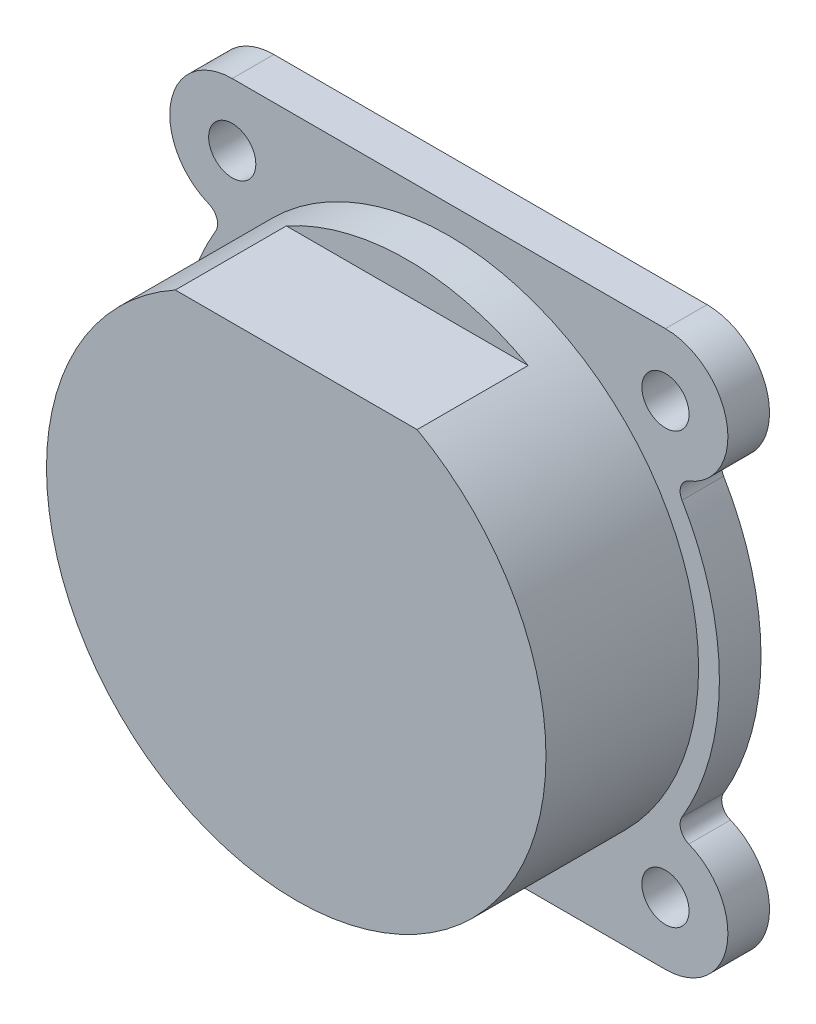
ISO-10303-21;
HEADER;
FILE_DESCRIPTION(('STEP AP214'),'2;1');
FILE_NAME('part.step','',(''),(''),'','','');
FILE_SCHEMA(('AUTOMOTIVE_DESIGN { 1 0 10303 214 1 1 1 1 }'));
ENDSEC;
DATA;
#1=APPLICATION_CONTEXT('core data for automotive mechanical design processes');
#2=APPLICATION_PROTOCOL_DEFINITION('international standard','automotive_design',2000,#1);
#3=PRODUCT_CONTEXT('',#1,'mechanical');
#4=PRODUCT('Part','Part','',(#3));
#5=PRODUCT_RELATED_PRODUCT_CATEGORY('part','',(#4));
#6=PRODUCT_DEFINITION_FORMATION('','',#4);
#7=PRODUCT_DEFINITION_CONTEXT('part definition',#1,'design');
#8=PRODUCT_DEFINITION('design','',#6,#7);
#9=PRODUCT_DEFINITION_SHAPE('','',#8);
#10=(LENGTH_UNIT() NAMED_UNIT(*) SI_UNIT(.MILLI.,.METRE.));
#11=(NAMED_UNIT(*) PLANE_ANGLE_UNIT() SI_UNIT($,.RADIAN.));
#12=(NAMED_UNIT(*) SI_UNIT($,.STERADIAN.) SOLID_ANGLE_UNIT());
#13=UNCERTAINTY_MEASURE_WITH_UNIT(LENGTH_MEASURE(1.E-05),#10,'distance_accuracy_value','');
#14=(GEOMETRIC_REPRESENTATION_CONTEXT(3) GLOBAL_UNCERTAINTY_ASSIGNED_CONTEXT((#13)) GLOBAL_UNIT_ASSIGNED_CONTEXT((#10,
#11,#12)) REPRESENTATION_CONTEXT('',''));
#15=CARTESIAN_POINT('',(0.,0.,0.));
#16=DIRECTION('',(0.,0.,1.));
#17=DIRECTION('',(1.,0.,0.));
#18=AXIS2_PLACEMENT_3D('',#15,#16,#17);
#19=CARTESIAN_POINT('',(-17.6671332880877,-10.398190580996,14.));
#20=DIRECTION('',(0.,0.,-1.));
#21=DIRECTION('',(-1.,0.,0.));
#22=AXIS2_PLACEMENT_3D('',#19,#20,#21);
#23=CYLINDRICAL_SURFACE('',#22,0.99999968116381);
#24=CARTESIAN_POINT('',(-17.6671332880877,-10.398190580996,3.));
#25=DIRECTION('',(0.,0.,1.));
#26=DIRECTION('',(1.,0.,0.));
#27=AXIS2_PLACEMENT_3D('',#24,#25,#26);
#28=CIRCLE('',#27,0.99999968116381);
#29=CARTESIAN_POINT('',(-16.8053221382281,-9.89096193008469,3.));
#30=VERTEX_POINT('',#29);
#31=CARTESIAN_POINT('',(-17.2935626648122,-11.3257919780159,3.));
#32=VERTEX_POINT('',#31);
#33=EDGE_CURVE('E192',#30,#32,#28,.F.);
#34=ORIENTED_EDGE('',*,*,#33,.F.);
#35=DIRECTION('',(0.,0.,-1.));
#36=VECTOR('',#35,1.);
#37=CARTESIAN_POINT('',(-16.8053221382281,-9.89096193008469,14.));
#38=LINE('',#37,#36);
#39=CARTESIAN_POINT('',(-16.8053221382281,-9.89096193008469,0.));
#40=VERTEX_POINT('',#39);
#41=EDGE_CURVE('E230',#30,#40,#38,.T.);
#42=ORIENTED_EDGE('',*,*,#41,.T.);
#43=CARTESIAN_POINT('',(-17.6671332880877,-10.398190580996,0.));
#44=DIRECTION('',(0.,0.,-1.));
#45=DIRECTION('',(-1.,0.,0.));
#46=AXIS2_PLACEMENT_3D('',#43,#44,#45);
#47=CIRCLE('',#46,0.99999968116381);
#48=CARTESIAN_POINT('',(-17.2935626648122,-11.3257919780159,0.));
#49=VERTEX_POINT('',#48);
#50=EDGE_CURVE('E194',#40,#49,#47,.T.);
#51=ORIENTED_EDGE('',*,*,#50,.T.);
#52=DIRECTION('',(0.,0.,-1.));
#53=VECTOR('',#52,1.);
#54=CARTESIAN_POINT('',(-17.2935626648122,-11.3257919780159,14.));
#55=LINE('',#54,#53);
#56=EDGE_CURVE('E252',#32,#49,#55,.T.);
#57=ORIENTED_EDGE('',*,*,#56,.F.);
#58=EDGE_LOOP('',(#34,#42,#51,#57));
#59=FACE_BOUND('',#58,.T.);
#60=ADVANCED_FACE('F32',(#59),#23,.F.);
#61=CARTESIAN_POINT('',(-15.6124942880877,-15.499999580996,14.));
#62=DIRECTION('',(0.,0.,-1.));
#63=DIRECTION('',(-1.,0.,0.));
#64=AXIS2_PLACEMENT_3D('',#61,#62,#63);
#65=CYLINDRICAL_SURFACE('',#64,4.5);
#66=CARTESIAN_POINT('',(-15.6124942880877,-15.499999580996,3.));
#67=DIRECTION('',(0.,0.,1.));
#68=DIRECTION('',(1.,0.,0.));
#69=AXIS2_PLACEMENT_3D('',#66,#67,#68);
#70=CIRCLE('',#69,4.5);
#71=CARTESIAN_POINT('',(-15.612495,-19.9999995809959,3.));
#72=VERTEX_POINT('',#71);
#73=EDGE_CURVE('E190',#32,#72,#70,.T.);
#74=ORIENTED_EDGE('',*,*,#73,.F.);
#75=ORIENTED_EDGE('',*,*,#56,.T.);
#76=CARTESIAN_POINT('',(-15.6124942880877,-15.499999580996,0.));
#77=DIRECTION('',(0.,0.,1.));
#78=DIRECTION('',(-1.,0.,0.));
#79=AXIS2_PLACEMENT_3D('',#76,#77,#78);
#80=CIRCLE('',#79,4.5);
#81=CARTESIAN_POINT('',(-15.612495,-19.9999995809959,0.));
#82=VERTEX_POINT('',#81);
#83=EDGE_CURVE('E197',#49,#82,#80,.T.);
#84=ORIENTED_EDGE('',*,*,#83,.T.);
#85=DIRECTION('',(0.,0.,-1.));
#86=VECTOR('',#85,1.);
#87=CARTESIAN_POINT('',(-15.612495,-19.9999995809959,14.));
#88=LINE('',#87,#86);
#89=EDGE_CURVE('E250',#72,#82,#88,.T.);
#90=ORIENTED_EDGE('',*,*,#89,.F.);
#91=EDGE_LOOP('',(#74,#75,#84,#90));
#92=FACE_BOUND('',#91,.T.);
#93=ADVANCED_FACE('F280',(#92),#65,.T.);
#94=CARTESIAN_POINT('',(-15.612495,-19.9999995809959,14.));
#95=DIRECTION('',(0.,1.,0.));
#96=DIRECTION('',(-1.,0.,0.));
#97=AXIS2_PLACEMENT_3D('',#94,#95,#96);
#98=PLANE('',#97);
#99=DIRECTION('',(1.,0.,0.));
#100=VECTOR('',#99,1.);
#101=CARTESIAN_POINT('',(-15.612495,-19.9999995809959,3.));
#102=LINE('',#101,#100);
#103=CARTESIAN_POINT('',(15.612495,-19.9999995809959,3.));
#104=VERTEX_POINT('',#103);
#105=EDGE_CURVE('E188',#72,#104,#102,.T.);
#106=ORIENTED_EDGE('',*,*,#105,.F.);
#107=ORIENTED_EDGE('',*,*,#89,.T.);
#108=DIRECTION('',(1.,0.,0.));
#109=VECTOR('',#108,1.);
#110=CARTESIAN_POINT('',(-15.612495,-19.9999995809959,0.));
#111=LINE('',#110,#109);
#112=CARTESIAN_POINT('',(15.612495,-19.9999995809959,0.));
#113=VERTEX_POINT('',#112);
#114=EDGE_CURVE('E200',#82,#113,#111,.T.);
#115=ORIENTED_EDGE('',*,*,#114,.T.);
#116=DIRECTION('',(0.,0.,-1.));
#117=VECTOR('',#116,1.);
#118=CARTESIAN_POINT('',(15.612495,-19.9999995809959,14.));
#119=LINE('',#118,#117);
#120=EDGE_CURVE('E248',#104,#113,#119,.T.);
#121=ORIENTED_EDGE('',*,*,#120,.F.);
#122=EDGE_LOOP('',(#106,#107,#115,#121));
#123=FACE_BOUND('',#122,.T.);
#124=ADVANCED_FACE('F285',(#123),#98,.F.);
#125=CARTESIAN_POINT('',(15.6124942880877,-15.499999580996,14.));
#126=DIRECTION('',(0.,0.,-1.));
#127=DIRECTION('',(-1.,0.,0.));
#128=AXIS2_PLACEMENT_3D('',#125,#126,#127);
#129=CYLINDRICAL_SURFACE('',#128,4.5);
#130=CARTESIAN_POINT('',(15.6124942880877,-15.499999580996,3.));
#131=DIRECTION('',(0.,0.,1.));
#132=DIRECTION('',(1.,0.,0.));
#133=AXIS2_PLACEMENT_3D('',#130,#131,#132);
#134=CIRCLE('',#133,4.5);
#135=CARTESIAN_POINT('',(17.2935626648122,-11.3257919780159,3.));
#136=VERTEX_POINT('',#135);
#137=EDGE_CURVE('E186',#104,#136,#134,.T.);
#138=ORIENTED_EDGE('',*,*,#137,.F.);
#139=ORIENTED_EDGE('',*,*,#120,.T.);
#140=CARTESIAN_POINT('',(15.6124942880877,-15.499999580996,0.));
#141=DIRECTION('',(0.,0.,1.));
#142=DIRECTION('',(1.,0.,0.));
#143=AXIS2_PLACEMENT_3D('',#140,#141,#142);
#144=CIRCLE('',#143,4.5);
#145=CARTESIAN_POINT('',(17.2935626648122,-11.3257919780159,0.));
#146=VERTEX_POINT('',#145);
#147=EDGE_CURVE('E203',#113,#146,#144,.T.);
#148=ORIENTED_EDGE('',*,*,#147,.T.);
#149=DIRECTION('',(0.,0.,-1.));
#150=VECTOR('',#149,1.);
#151=CARTESIAN_POINT('',(17.2935626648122,-11.3257919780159,14.));
#152=LINE('',#151,#150);
#153=EDGE_CURVE('E246',#136,#146,#152,.T.);
#154=ORIENTED_EDGE('',*,*,#153,.F.);
#155=EDGE_LOOP('',(#138,#139,#148,#154));
#156=FACE_BOUND('',#155,.T.);
#157=ADVANCED_FACE('F308',(#156),#129,.T.);
#158=CARTESIAN_POINT('',(17.6671332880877,-10.398190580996,14.));
#159=DIRECTION('',(0.,0.,-1.));
#160=DIRECTION('',(-1.,0.,0.));
#161=AXIS2_PLACEMENT_3D('',#158,#159,#160);
#162=CYLINDRICAL_SURFACE('',#161,0.99999968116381);
#163=CARTESIAN_POINT('',(17.6671332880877,-10.398190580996,3.));
#164=DIRECTION('',(0.,0.,1.));
#165=DIRECTION('',(1.,0.,0.));
#166=AXIS2_PLACEMENT_3D('',#163,#164,#165);
#167=CIRCLE('',#166,0.99999968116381);
#168=CARTESIAN_POINT('',(16.8053221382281,-9.89096193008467,3.));
#169=VERTEX_POINT('',#168);
#170=EDGE_CURVE('E184',#136,#169,#167,.F.);
#171=ORIENTED_EDGE('',*,*,#170,.F.);
#172=ORIENTED_EDGE('',*,*,#153,.T.);
#173=CARTESIAN_POINT('',(17.6671332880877,-10.398190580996,0.));
#174=DIRECTION('',(0.,0.,-1.));
#175=DIRECTION('',(1.,0.,0.));
#176=AXIS2_PLACEMENT_3D('',#173,#174,#175);
#177=CIRCLE('',#176,0.99999968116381);
#178=CARTESIAN_POINT('',(16.8053221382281,-9.89096193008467,0.));
#179=VERTEX_POINT('',#178);
#180=EDGE_CURVE('E206',#146,#179,#177,.T.);
#181=ORIENTED_EDGE('',*,*,#180,.T.);
#182=DIRECTION('',(0.,0.,-1.));
#183=VECTOR('',#182,1.);
#184=CARTESIAN_POINT('',(16.8053221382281,-9.89096193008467,14.));
#185=LINE('',#184,#183);
#186=EDGE_CURVE('E244',#169,#179,#185,.T.);
#187=ORIENTED_EDGE('',*,*,#186,.F.);
#188=EDGE_LOOP('',(#171,#172,#181,#187));
#189=FACE_BOUND('',#188,.T.);
#190=ADVANCED_FACE('F315',(#189),#162,.F.);
#191=CARTESIAN_POINT('',(0.,0.,14.));
#192=DIRECTION('',(0.,0.,-1.));
#193=DIRECTION('',(-1.,0.,0.));
#194=AXIS2_PLACEMENT_3D('',#191,#192,#193);
#195=CYLINDRICAL_SURFACE('',#194,19.4999994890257);
#196=CARTESIAN_POINT('',(0.,0.,3.));
#197=DIRECTION('',(0.,0.,1.));
#198=DIRECTION('',(1.,0.,0.));
#199=AXIS2_PLACEMENT_3D('',#196,#197,#198);
#200=CIRCLE('',#199,19.4999994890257);
#201=CARTESIAN_POINT('',(16.8053225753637,9.89096118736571,3.));
#202=VERTEX_POINT('',#201);
#203=EDGE_CURVE('E182',#169,#202,#200,.T.);
#204=ORIENTED_EDGE('',*,*,#203,.F.);
#205=ORIENTED_EDGE('',*,*,#186,.T.);
#206=CARTESIAN_POINT('',(0.,0.,0.));
#207=DIRECTION('',(0.,0.,1.));
#208=DIRECTION('',(1.,0.,0.));
#209=AXIS2_PLACEMENT_3D('',#206,#207,#208);
#210=CIRCLE('',#209,19.4999994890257);
#211=CARTESIAN_POINT('',(16.8053225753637,9.89096118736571,0.));
#212=VERTEX_POINT('',#211);
#213=EDGE_CURVE('E209',#179,#212,#210,.T.);
#214=ORIENTED_EDGE('',*,*,#213,.T.);
#215=DIRECTION('',(0.,0.,-1.));
#216=VECTOR('',#215,1.);
#217=CARTESIAN_POINT('',(16.8053225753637,9.89096118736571,14.));
#218=LINE('',#217,#216);
#219=EDGE_CURVE('E242',#202,#212,#218,.T.);
#220=ORIENTED_EDGE('',*,*,#219,.F.);
#221=EDGE_LOOP('',(#204,#205,#214,#220));
#222=FACE_BOUND('',#221,.T.);
#223=ADVANCED_FACE('F318',(#222),#195,.T.);
#224=CARTESIAN_POINT('',(17.667134,10.39819,14.));
#225=DIRECTION('',(0.,0.,-1.));
#226=DIRECTION('',(-1.,0.,0.));
#227=AXIS2_PLACEMENT_3D('',#224,#225,#226);
#228=CYLINDRICAL_SURFACE('',#227,1.00000000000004);
#229=CARTESIAN_POINT('',(17.667134,10.39819,3.));
#230=DIRECTION('',(0.,0.,1.));
#231=DIRECTION('',(1.,0.,0.));
#232=AXIS2_PLACEMENT_3D('',#229,#230,#231);
#233=CIRCLE('',#232,1.00000000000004);
#234=CARTESIAN_POINT('',(17.2935636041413,11.3257918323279,3.));
#235=VERTEX_POINT('',#234);
#236=EDGE_CURVE('E180',#202,#235,#233,.F.);
#237=ORIENTED_EDGE('',*,*,#236,.F.);
#238=ORIENTED_EDGE('',*,*,#219,.T.);
#239=CARTESIAN_POINT('',(17.667134,10.39819,0.));
#240=DIRECTION('',(0.,0.,-1.));
#241=DIRECTION('',(1.,0.,0.));
#242=AXIS2_PLACEMENT_3D('',#239,#240,#241);
#243=CIRCLE('',#242,1.00000000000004);
#244=CARTESIAN_POINT('',(17.2935636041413,11.3257918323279,0.));
#245=VERTEX_POINT('',#244);
#246=EDGE_CURVE('E212',#212,#245,#243,.T.);
#247=ORIENTED_EDGE('',*,*,#246,.T.);
#248=DIRECTION('',(0.,0.,-1.));
#249=VECTOR('',#248,1.);
#250=CARTESIAN_POINT('',(17.2935636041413,11.3257918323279,14.));
#251=LINE('',#250,#249);
#252=EDGE_CURVE('E240',#235,#245,#251,.T.);
#253=ORIENTED_EDGE('',*,*,#252,.F.);
#254=EDGE_LOOP('',(#237,#238,#247,#253));
#255=FACE_BOUND('',#254,.T.);
#256=ADVANCED_FACE('F325',(#255),#228,.F.);
#257=CARTESIAN_POINT('',(15.6124952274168,15.499999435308,14.));
#258=DIRECTION('',(0.,0.,-1.));
#259=DIRECTION('',(-1.,0.,0.));
#260=AXIS2_PLACEMENT_3D('',#257,#258,#259);
#261=CYLINDRICAL_SURFACE('',#260,4.5);
#262=CARTESIAN_POINT('',(15.6124952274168,15.499999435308,3.));
#263=DIRECTION('',(0.,0.,1.));
#264=DIRECTION('',(1.,0.,0.));
#265=AXIS2_PLACEMENT_3D('',#262,#263,#264);
#266=CIRCLE('',#265,4.5);
#267=CARTESIAN_POINT('',(15.6124952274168,19.999999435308,3.));
#268=VERTEX_POINT('',#267);
#269=EDGE_CURVE('E178',#235,#268,#266,.T.);
#270=ORIENTED_EDGE('',*,*,#269,.F.);
#271=ORIENTED_EDGE('',*,*,#252,.T.);
#272=CARTESIAN_POINT('',(15.6124952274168,15.499999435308,0.));
#273=DIRECTION('',(0.,0.,1.));
#274=DIRECTION('',(1.,0.,0.));
#275=AXIS2_PLACEMENT_3D('',#272,#273,#274);
#276=CIRCLE('',#275,4.5);
#277=CARTESIAN_POINT('',(15.6124952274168,19.999999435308,0.));
#278=VERTEX_POINT('',#277);
#279=EDGE_CURVE('E215',#245,#278,#276,.T.);
#280=ORIENTED_EDGE('',*,*,#279,.T.);
#281=DIRECTION('',(0.,0.,-1.));
#282=VECTOR('',#281,1.);
#283=CARTESIAN_POINT('',(15.6124952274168,19.999999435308,14.));
#284=LINE('',#283,#282);
#285=EDGE_CURVE('E238',#268,#278,#284,.T.);
#286=ORIENTED_EDGE('',*,*,#285,.F.);
#287=EDGE_LOOP('',(#270,#271,#280,#286));
#288=FACE_BOUND('',#287,.T.);
#289=ADVANCED_FACE('F328',(#288),#261,.T.);
#290=CARTESIAN_POINT('',(15.6124952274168,19.999999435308,14.));
#291=DIRECTION('',(-1.81500077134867E-08,-1.,0.));
#292=DIRECTION('',(1.,-1.81500077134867E-08,0.));
#293=AXIS2_PLACEMENT_3D('',#290,#291,#292);
#294=PLANE('',#293);
#295=DIRECTION('',(-1.,1.81500077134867E-08,0.));
#296=VECTOR('',#295,1.);
#297=CARTESIAN_POINT('',(15.6124952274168,19.999999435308,3.));
#298=LINE('',#297,#296);
#299=CARTESIAN_POINT('',(-15.6124951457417,19.9999997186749,3.));
#300=VERTEX_POINT('',#299);
#301=EDGE_CURVE('E176',#268,#300,#298,.T.);
#302=ORIENTED_EDGE('',*,*,#301,.F.);
#303=ORIENTED_EDGE('',*,*,#285,.T.);
#304=DIRECTION('',(-1.,1.81500077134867E-08,0.));
#305=VECTOR('',#304,1.);
#306=CARTESIAN_POINT('',(15.6124952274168,19.999999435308,0.));
#307=LINE('',#306,#305);
#308=CARTESIAN_POINT('',(-15.6124951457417,19.9999997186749,0.));
#309=VERTEX_POINT('',#308);
#310=EDGE_CURVE('E218',#278,#309,#307,.T.);
#311=ORIENTED_EDGE('',*,*,#310,.T.);
#312=DIRECTION('',(0.,0.,-1.));
#313=VECTOR('',#312,1.);
#314=CARTESIAN_POINT('',(-15.6124951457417,19.9999997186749,14.));
#315=LINE('',#314,#313);
#316=EDGE_CURVE('E236',#300,#309,#315,.T.);
#317=ORIENTED_EDGE('',*,*,#316,.F.);
#318=EDGE_LOOP('',(#302,#303,#311,#317));
#319=FACE_BOUND('',#318,.T.);
#320=ADVANCED_FACE('F335',(#319),#294,.F.);
#321=CARTESIAN_POINT('',(-15.6124952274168,15.499999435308,14.));
#322=DIRECTION('',(0.,0.,-1.));
#323=DIRECTION('',(-1.,0.,0.));
#324=AXIS2_PLACEMENT_3D('',#321,#322,#323);
#325=CYLINDRICAL_SURFACE('',#324,4.50000028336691);
#326=CARTESIAN_POINT('',(-15.6124952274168,15.499999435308,3.));
#327=DIRECTION('',(0.,0.,1.));
#328=DIRECTION('',(1.,0.,0.));
#329=AXIS2_PLACEMENT_3D('',#326,#327,#328);
#330=CIRCLE('',#329,4.50000028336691);
#331=CARTESIAN_POINT('',(-17.2935636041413,11.3257918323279,3.));
#332=VERTEX_POINT('',#331);
#333=EDGE_CURVE('E174',#300,#332,#330,.T.);
#334=ORIENTED_EDGE('',*,*,#333,.F.);
#335=ORIENTED_EDGE('',*,*,#316,.T.);
#336=CARTESIAN_POINT('',(-15.6124952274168,15.499999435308,0.));
#337=DIRECTION('',(0.,0.,1.));
#338=DIRECTION('',(-1.,0.,0.));
#339=AXIS2_PLACEMENT_3D('',#336,#337,#338);
#340=CIRCLE('',#339,4.50000028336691);
#341=CARTESIAN_POINT('',(-17.2935636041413,11.3257918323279,0.));
#342=VERTEX_POINT('',#341);
#343=EDGE_CURVE('E221',#309,#342,#340,.T.);
#344=ORIENTED_EDGE('',*,*,#343,.T.);
#345=DIRECTION('',(0.,0.,-1.));
#346=VECTOR('',#345,1.);
#347=CARTESIAN_POINT('',(-17.2935636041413,11.3257918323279,14.));
#348=LINE('',#347,#346);
#349=EDGE_CURVE('E234',#332,#342,#348,.T.);
#350=ORIENTED_EDGE('',*,*,#349,.F.);
#351=EDGE_LOOP('',(#334,#335,#344,#350));
#352=FACE_BOUND('',#351,.T.);
#353=ADVANCED_FACE('F338',(#352),#325,.T.);
#354=CARTESIAN_POINT('',(-17.667134,10.39819,14.));
#355=DIRECTION('',(0.,0.,-1.));
#356=DIRECTION('',(-1.,0.,0.));
#357=AXIS2_PLACEMENT_3D('',#354,#355,#356);
#358=CYLINDRICAL_SURFACE('',#357,1.00000000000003);
#359=CARTESIAN_POINT('',(-17.667134,10.39819,3.));
#360=DIRECTION('',(0.,0.,1.));
#361=DIRECTION('',(1.,0.,0.));
#362=AXIS2_PLACEMENT_3D('',#359,#360,#361);
#363=CIRCLE('',#362,1.00000000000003);
#364=CARTESIAN_POINT('',(-16.8053225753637,9.8909611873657,3.));
#365=VERTEX_POINT('',#364);
#366=EDGE_CURVE('E54',#332,#365,#363,.F.);
#367=ORIENTED_EDGE('',*,*,#366,.F.);
#368=ORIENTED_EDGE('',*,*,#349,.T.);
#369=CARTESIAN_POINT('',(-17.667134,10.39819,0.));
#370=DIRECTION('',(0.,0.,-1.));
#371=DIRECTION('',(-1.,0.,0.));
#372=AXIS2_PLACEMENT_3D('',#369,#370,#371);
#373=CIRCLE('',#372,1.00000000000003);
#374=CARTESIAN_POINT('',(-16.8053225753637,9.8909611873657,0.));
#375=VERTEX_POINT('',#374);
#376=EDGE_CURVE('E224',#342,#375,#373,.T.);
#377=ORIENTED_EDGE('',*,*,#376,.T.);
#378=DIRECTION('',(0.,0.,-1.));
#379=VECTOR('',#378,1.);
#380=CARTESIAN_POINT('',(-16.8053225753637,9.8909611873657,14.));
#381=LINE('',#380,#379);
#382=EDGE_CURVE('E232',#365,#375,#381,.T.);
#383=ORIENTED_EDGE('',*,*,#382,.F.);
#384=EDGE_LOOP('',(#367,#368,#377,#383));
#385=FACE_BOUND('',#384,.T.);
#386=ADVANCED_FACE('F341',(#385),#358,.F.);
#387=CARTESIAN_POINT('',(0.,0.,14.));
#388=DIRECTION('',(0.,0.,-1.));
#389=DIRECTION('',(-1.,0.,0.));
#390=AXIS2_PLACEMENT_3D('',#387,#388,#389);
#391=CYLINDRICAL_SURFACE('',#390,19.4999994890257);
#392=CARTESIAN_POINT('',(0.,0.,3.));
#393=DIRECTION('',(0.,0.,1.));
#394=DIRECTION('',(1.,0.,0.));
#395=AXIS2_PLACEMENT_3D('',#392,#393,#394);
#396=CIRCLE('',#395,19.4999994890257);
#397=EDGE_CURVE('E254',#365,#30,#396,.T.);
#398=ORIENTED_EDGE('',*,*,#397,.F.);
#399=ORIENTED_EDGE('',*,*,#382,.T.);
#400=CARTESIAN_POINT('',(0.,0.,0.));
#401=DIRECTION('',(0.,0.,1.));
#402=DIRECTION('',(-1.,0.,0.));
#403=AXIS2_PLACEMENT_3D('',#400,#401,#402);
#404=CIRCLE('',#403,19.4999994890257);
#405=EDGE_CURVE('E227',#375,#40,#404,.T.);
#406=ORIENTED_EDGE('',*,*,#405,.T.);
#407=ORIENTED_EDGE('',*,*,#41,.F.);
#408=EDGE_LOOP('',(#398,#399,#406,#407));
#409=FACE_BOUND('',#408,.T.);
#410=ADVANCED_FACE('F292',(#409),#391,.T.);
#411=CARTESIAN_POINT('',(-17.6671332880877,-10.398190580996,0.));
#412=DIRECTION('',(0.,0.,-1.));
#413=DIRECTION('',(-1.,0.,0.));
#414=AXIS2_PLACEMENT_3D('',#411,#412,#413);
#415=PLANE('',#414);
#416=CARTESIAN_POINT('',(0.,0.,0.));
#417=DIRECTION('',(0.,0.,-1.));
#418=DIRECTION('',(-1.,0.,0.));
#419=AXIS2_PLACEMENT_3D('',#416,#417,#418);
#420=CIRCLE('',#419,15.);
#421=CARTESIAN_POINT('',(-15.,0.,0.));
#422=VERTEX_POINT('',#421);
#423=EDGE_CURVE('E138',#422,#422,#420,.T.);
#424=ORIENTED_EDGE('',*,*,#423,.F.);
#425=EDGE_LOOP('',(#424));
#426=FACE_BOUND('',#425,.T.);
#427=CARTESIAN_POINT('',(15.6124952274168,15.499999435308,0.));
#428=DIRECTION('',(0.,0.,-1.));
#429=DIRECTION('',(-1.,0.,0.));
#430=AXIS2_PLACEMENT_3D('',#427,#428,#429);
#431=CIRCLE('',#430,1.69999999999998);
#432=CARTESIAN_POINT('',(13.9124952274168,15.499999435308,0.));
#433=VERTEX_POINT('',#432);
#434=EDGE_CURVE('E156',#433,#433,#431,.T.);
#435=ORIENTED_EDGE('',*,*,#434,.F.);
#436=EDGE_LOOP('',(#435));
#437=FACE_BOUND('',#436,.T.);
#438=CARTESIAN_POINT('',(15.6124942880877,-15.499999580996,0.));
#439=DIRECTION('',(0.,0.,-1.));
#440=DIRECTION('',(-1.,0.,0.));
#441=AXIS2_PLACEMENT_3D('',#438,#439,#440);
#442=CIRCLE('',#441,1.69999999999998);
#443=CARTESIAN_POINT('',(13.9124942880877,-15.499999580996,0.));
#444=VERTEX_POINT('',#443);
#445=EDGE_CURVE('E160',#444,#444,#442,.T.);
#446=ORIENTED_EDGE('',*,*,#445,.F.);
#447=EDGE_LOOP('',(#446));
#448=FACE_BOUND('',#447,.T.);
#449=CARTESIAN_POINT('',(-15.6124952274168,15.499999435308,0.));
#450=DIRECTION('',(0.,0.,-1.));
#451=DIRECTION('',(-1.,0.,0.));
#452=AXIS2_PLACEMENT_3D('',#449,#450,#451);
#453=CIRCLE('',#452,1.69999999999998);
#454=CARTESIAN_POINT('',(-17.3124952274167,15.499999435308,0.));
#455=VERTEX_POINT('',#454);
#456=EDGE_CURVE('E164',#455,#455,#453,.T.);
#457=ORIENTED_EDGE('',*,*,#456,.F.);
#458=EDGE_LOOP('',(#457));
#459=FACE_BOUND('',#458,.T.);
#460=CARTESIAN_POINT('',(-15.6124942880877,-15.499999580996,0.));
#461=DIRECTION('',(0.,0.,-1.));
#462=DIRECTION('',(-1.,0.,0.));
#463=AXIS2_PLACEMENT_3D('',#460,#461,#462);
#464=CIRCLE('',#463,1.69999999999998);
#465=CARTESIAN_POINT('',(-17.3124942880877,-15.499999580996,0.));
#466=VERTEX_POINT('',#465);
#467=EDGE_CURVE('E168',#466,#466,#464,.T.);
#468=ORIENTED_EDGE('',*,*,#467,.F.);
#469=EDGE_LOOP('',(#468));
#470=FACE_BOUND('',#469,.T.);
#471=ORIENTED_EDGE('',*,*,#50,.F.);
#472=ORIENTED_EDGE('',*,*,#405,.F.);
#473=ORIENTED_EDGE('',*,*,#376,.F.);
#474=ORIENTED_EDGE('',*,*,#343,.F.);
#475=ORIENTED_EDGE('',*,*,#310,.F.);
#476=ORIENTED_EDGE('',*,*,#279,.F.);
#477=ORIENTED_EDGE('',*,*,#246,.F.);
#478=ORIENTED_EDGE('',*,*,#213,.F.);
#479=ORIENTED_EDGE('',*,*,#180,.F.);
#480=ORIENTED_EDGE('',*,*,#147,.F.);
#481=ORIENTED_EDGE('',*,*,#114,.F.);
#482=ORIENTED_EDGE('',*,*,#83,.F.);
#483=EDGE_LOOP('',(#471,#472,#473,#474,#475,#476,#477,#478,#479,#480,#481,#482));
#484=FACE_BOUND('',#483,.T.);
#485=ADVANCED_FACE('F299',(#426,#437,#448,#459,#470,#484),#415,.T.);
#486=CARTESIAN_POINT('',(0.,0.,3.));
#487=DIRECTION('',(0.,0.,1.));
#488=DIRECTION('',(1.,0.,0.));
#489=AXIS2_PLACEMENT_3D('',#486,#487,#488);
#490=PLANE('',#489);
#491=CARTESIAN_POINT('',(15.6124952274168,15.499999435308,3.));
#492=DIRECTION('',(0.,0.,1.));
#493=DIRECTION('',(1.,0.,0.));
#494=AXIS2_PLACEMENT_3D('',#491,#492,#493);
#495=CIRCLE('',#494,1.69999999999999);
#496=CARTESIAN_POINT('',(17.3124952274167,15.499999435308,3.));
#497=VERTEX_POINT('',#496);
#498=EDGE_CURVE('E153',#497,#497,#495,.T.);
#499=ORIENTED_EDGE('',*,*,#498,.F.);
#500=EDGE_LOOP('',(#499));
#501=FACE_BOUND('',#500,.T.);
#502=CARTESIAN_POINT('',(15.6124942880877,-15.499999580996,3.));
#503=DIRECTION('',(0.,0.,1.));
#504=DIRECTION('',(1.,0.,0.));
#505=AXIS2_PLACEMENT_3D('',#502,#503,#504);
#506=CIRCLE('',#505,1.69999999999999);
#507=CARTESIAN_POINT('',(17.3124942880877,-15.499999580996,3.));
#508=VERTEX_POINT('',#507);
#509=EDGE_CURVE('E157',#508,#508,#506,.T.);
#510=ORIENTED_EDGE('',*,*,#509,.F.);
#511=EDGE_LOOP('',(#510));
#512=FACE_BOUND('',#511,.T.);
#513=CARTESIAN_POINT('',(-15.6124952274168,15.499999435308,3.));
#514=DIRECTION('',(0.,0.,1.));
#515=DIRECTION('',(1.,0.,0.));
#516=AXIS2_PLACEMENT_3D('',#513,#514,#515);
#517=CIRCLE('',#516,1.69999999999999);
#518=CARTESIAN_POINT('',(-13.9124952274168,15.499999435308,3.));
#519=VERTEX_POINT('',#518);
#520=EDGE_CURVE('E161',#519,#519,#517,.T.);
#521=ORIENTED_EDGE('',*,*,#520,.F.);
#522=EDGE_LOOP('',(#521));
#523=FACE_BOUND('',#522,.T.);
#524=CARTESIAN_POINT('',(-15.6124942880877,-15.499999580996,3.));
#525=DIRECTION('',(0.,0.,1.));
#526=DIRECTION('',(1.,0.,0.));
#527=AXIS2_PLACEMENT_3D('',#524,#525,#526);
#528=CIRCLE('',#527,1.69999999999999);
#529=CARTESIAN_POINT('',(-13.9124942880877,-15.499999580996,3.));
#530=VERTEX_POINT('',#529);
#531=EDGE_CURVE('E165',#530,#530,#528,.T.);
#532=ORIENTED_EDGE('',*,*,#531,.F.);
#533=EDGE_LOOP('',(#532));
#534=FACE_BOUND('',#533,.T.);
#535=CARTESIAN_POINT('',(0.,0.,3.));
#536=DIRECTION('',(0.,0.,1.));
#537=DIRECTION('',(1.,0.,0.));
#538=AXIS2_PLACEMENT_3D('',#535,#536,#537);
#539=CIRCLE('',#538,18.);
#540=CARTESIAN_POINT('',(18.,0.,3.));
#541=VERTEX_POINT('',#540);
#542=EDGE_CURVE('E170',#541,#541,#539,.T.);
#543=ORIENTED_EDGE('',*,*,#542,.F.);
#544=EDGE_LOOP('',(#543));
#545=FACE_BOUND('',#544,.T.);
#546=ORIENTED_EDGE('',*,*,#33,.T.);
#547=ORIENTED_EDGE('',*,*,#73,.T.);
#548=ORIENTED_EDGE('',*,*,#105,.T.);
#549=ORIENTED_EDGE('',*,*,#137,.T.);
#550=ORIENTED_EDGE('',*,*,#170,.T.);
#551=ORIENTED_EDGE('',*,*,#203,.T.);
#552=ORIENTED_EDGE('',*,*,#236,.T.);
#553=ORIENTED_EDGE('',*,*,#269,.T.);
#554=ORIENTED_EDGE('',*,*,#301,.T.);
#555=ORIENTED_EDGE('',*,*,#333,.T.);
#556=ORIENTED_EDGE('',*,*,#366,.T.);
#557=ORIENTED_EDGE('',*,*,#397,.T.);
#558=EDGE_LOOP('',(#546,#547,#548,#549,#550,#551,#552,#553,#554,#555,#556,#557));
#559=FACE_BOUND('',#558,.T.);
#560=ADVANCED_FACE('F275',(#501,#512,#523,#534,#545,#559),#490,.T.);
#561=CARTESIAN_POINT('',(0.,0.,3.));
#562=DIRECTION('',(0.,0.,1.));
#563=DIRECTION('',(1.,0.,0.));
#564=AXIS2_PLACEMENT_3D('',#561,#562,#563);
#565=CYLINDRICAL_SURFACE('',#564,18.);
#566=DIRECTION('',(0.,0.,1.));
#567=VECTOR('',#566,1.);
#568=CARTESIAN_POINT('',(8.71421252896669,15.75,3.));
#569=LINE('',#568,#567);
#570=CARTESIAN_POINT('',(8.71421252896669,15.75,14.));
#571=VERTEX_POINT('',#570);
#572=CARTESIAN_POINT('',(8.71421252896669,15.75,6.));
#573=VERTEX_POINT('',#572);
#574=EDGE_CURVE('E131',#571,#573,#569,.F.);
#575=ORIENTED_EDGE('',*,*,#574,.F.);
#576=CARTESIAN_POINT('',(0.,0.,14.));
#577=DIRECTION('',(0.,0.,1.));
#578=DIRECTION('',(1.,0.,0.));
#579=AXIS2_PLACEMENT_3D('',#576,#577,#578);
#580=CIRCLE('',#579,18.);
#581=CARTESIAN_POINT('',(-8.71421252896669,15.75,14.));
#582=VERTEX_POINT('',#581);
#583=EDGE_CURVE('E145',#582,#571,#580,.T.);
#584=ORIENTED_EDGE('',*,*,#583,.F.);
#585=DIRECTION('',(0.,0.,1.));
#586=VECTOR('',#585,1.);
#587=CARTESIAN_POINT('',(-8.71421252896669,15.75,3.));
#588=LINE('',#587,#586);
#589=CARTESIAN_POINT('',(-8.71421252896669,15.75,6.));
#590=VERTEX_POINT('',#589);
#591=EDGE_CURVE('E46',#590,#582,#588,.T.);
#592=ORIENTED_EDGE('',*,*,#591,.F.);
#593=CARTESIAN_POINT('',(0.,0.,6.));
#594=DIRECTION('',(0.,0.,1.));
#595=DIRECTION('',(1.,0.,0.));
#596=AXIS2_PLACEMENT_3D('',#593,#594,#595);
#597=CIRCLE('',#596,18.);
#598=EDGE_CURVE('E11',#590,#573,#597,.F.);
#599=ORIENTED_EDGE('',*,*,#598,.T.);
#600=EDGE_LOOP('',(#575,#584,#592,#599));
#601=FACE_BOUND('',#600,.T.);
#602=ORIENTED_EDGE('',*,*,#542,.T.);
#603=EDGE_LOOP('',(#602));
#604=FACE_BOUND('',#603,.T.);
#605=ADVANCED_FACE('F143',(#601,#604),#565,.T.);
#606=CARTESIAN_POINT('',(-17.6671332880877,-10.398190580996,14.));
#607=DIRECTION('',(0.,0.,-1.));
#608=DIRECTION('',(-1.,0.,0.));
#609=AXIS2_PLACEMENT_3D('',#606,#607,#608);
#610=PLANE('',#609);
#611=ORIENTED_EDGE('',*,*,#583,.T.);
#612=DIRECTION('',(-1.,0.,0.));
#613=VECTOR('',#612,1.);
#614=CARTESIAN_POINT('',(-17.6671332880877,15.75,14.));
#615=LINE('',#614,#613);
#616=EDGE_CURVE('E39',#571,#582,#615,.T.);
#617=ORIENTED_EDGE('',*,*,#616,.T.);
#618=EDGE_LOOP('',(#611,#617));
#619=FACE_BOUND('',#618,.T.);
#620=ADVANCED_FACE('F264',(#619),#610,.F.);
#621=CARTESIAN_POINT('',(-15.6124942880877,-15.499999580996,3.));
#622=DIRECTION('',(0.,0.,1.));
#623=DIRECTION('',(1.,0.,0.));
#624=AXIS2_PLACEMENT_3D('',#621,#622,#623);
#625=CYLINDRICAL_SURFACE('',#624,1.69999999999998);
#626=ORIENTED_EDGE('',*,*,#467,.T.);
#627=EDGE_LOOP('',(#626));
#628=FACE_BOUND('',#627,.T.);
#629=ORIENTED_EDGE('',*,*,#531,.T.);
#630=EDGE_LOOP('',(#629));
#631=FACE_BOUND('',#630,.T.);
#632=ADVANCED_FACE('F266',(#628,#631),#625,.F.);
#633=CARTESIAN_POINT('',(-15.6124952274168,15.499999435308,3.));
#634=DIRECTION('',(0.,0.,1.));
#635=DIRECTION('',(1.,0.,0.));
#636=AXIS2_PLACEMENT_3D('',#633,#634,#635);
#637=CYLINDRICAL_SURFACE('',#636,1.69999999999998);
#638=ORIENTED_EDGE('',*,*,#456,.T.);
#639=EDGE_LOOP('',(#638));
#640=FACE_BOUND('',#639,.T.);
#641=ORIENTED_EDGE('',*,*,#520,.T.);
#642=EDGE_LOOP('',(#641));
#643=FACE_BOUND('',#642,.T.);
#644=ADVANCED_FACE('F272',(#640,#643),#637,.F.);
#645=CARTESIAN_POINT('',(15.6124942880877,-15.499999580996,3.));
#646=DIRECTION('',(0.,0.,1.));
#647=DIRECTION('',(1.,0.,0.));
#648=AXIS2_PLACEMENT_3D('',#645,#646,#647);
#649=CYLINDRICAL_SURFACE('',#648,1.69999999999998);
#650=ORIENTED_EDGE('',*,*,#445,.T.);
#651=EDGE_LOOP('',(#650));
#652=FACE_BOUND('',#651,.T.);
#653=ORIENTED_EDGE('',*,*,#509,.T.);
#654=EDGE_LOOP('',(#653));
#655=FACE_BOUND('',#654,.T.);
#656=ADVANCED_FACE('F448',(#652,#655),#649,.F.);
#657=CARTESIAN_POINT('',(15.6124952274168,15.499999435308,3.));
#658=DIRECTION('',(0.,0.,1.));
#659=DIRECTION('',(1.,0.,0.));
#660=AXIS2_PLACEMENT_3D('',#657,#658,#659);
#661=CYLINDRICAL_SURFACE('',#660,1.69999999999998);
#662=ORIENTED_EDGE('',*,*,#434,.T.);
#663=EDGE_LOOP('',(#662));
#664=FACE_BOUND('',#663,.T.);
#665=ORIENTED_EDGE('',*,*,#498,.T.);
#666=EDGE_LOOP('',(#665));
#667=FACE_BOUND('',#666,.T.);
#668=ADVANCED_FACE('F458',(#664,#667),#661,.F.);
#669=CARTESIAN_POINT('',(0.,0.,11.));
#670=DIRECTION('',(0.,0.,-1.));
#671=DIRECTION('',(-1.,0.,0.));
#672=AXIS2_PLACEMENT_3D('',#669,#670,#671);
#673=CYLINDRICAL_SURFACE('',#672,15.);
#674=CARTESIAN_POINT('',(0.,0.,11.));
#675=DIRECTION('',(0.,0.,-1.));
#676=DIRECTION('',(-1.,0.,0.));
#677=AXIS2_PLACEMENT_3D('',#674,#675,#676);
#678=CIRCLE('',#677,15.);
#679=CARTESIAN_POINT('',(-15.,0.,11.));
#680=VERTEX_POINT('',#679);
#681=EDGE_CURVE('E150',#680,#680,#678,.T.);
#682=ORIENTED_EDGE('',*,*,#681,.F.);
#683=EDGE_LOOP('',(#682));
#684=FACE_BOUND('',#683,.T.);
#685=ORIENTED_EDGE('',*,*,#423,.T.);
#686=EDGE_LOOP('',(#685));
#687=FACE_BOUND('',#686,.T.);
#688=ADVANCED_FACE('F468',(#684,#687),#673,.F.);
#689=CARTESIAN_POINT('',(0.,0.,11.));
#690=DIRECTION('',(0.,0.,-1.));
#691=DIRECTION('',(-1.,0.,0.));
#692=AXIS2_PLACEMENT_3D('',#689,#690,#691);
#693=PLANE('',#692);
#694=ORIENTED_EDGE('',*,*,#681,.T.);
#695=EDGE_LOOP('',(#694));
#696=FACE_BOUND('',#695,.T.);
#697=ADVANCED_FACE('F478',(#696),#693,.T.);
#698=CARTESIAN_POINT('',(-20.,19.9999997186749,6.));
#699=DIRECTION('',(0.,0.,1.));
#700=DIRECTION('',(1.,0.,0.));
#701=AXIS2_PLACEMENT_3D('',#698,#699,#700);
#702=PLANE('',#701);
#703=DIRECTION('',(-1.,0.,0.));
#704=VECTOR('',#703,1.);
#705=CARTESIAN_POINT('',(-20.,15.75,6.));
#706=LINE('',#705,#704);
#707=EDGE_CURVE('E134',#573,#590,#706,.T.);
#708=ORIENTED_EDGE('',*,*,#707,.F.);
#709=ORIENTED_EDGE('',*,*,#598,.F.);
#710=EDGE_LOOP('',(#708,#709));
#711=FACE_BOUND('',#710,.T.);
#712=ADVANCED_FACE('F141',(#711),#702,.T.);
#713=CARTESIAN_POINT('',(-20.,15.75,14.));
#714=DIRECTION('',(0.,-1.,0.));
#715=DIRECTION('',(0.,0.,-1.));
#716=AXIS2_PLACEMENT_3D('',#713,#714,#715);
#717=PLANE('',#716);
#718=ORIENTED_EDGE('',*,*,#574,.T.);
#719=ORIENTED_EDGE('',*,*,#707,.T.);
#720=ORIENTED_EDGE('',*,*,#591,.T.);
#721=ORIENTED_EDGE('',*,*,#616,.F.);
#722=EDGE_LOOP('',(#718,#719,#720,#721));
#723=FACE_BOUND('',#722,.T.);
#724=ADVANCED_FACE('F133',(#723),#717,.F.);
#725=CLOSED_SHELL('',(#60,#93,#124,#157,#190,#223,#256,#289,#320,#353,#386,#410,#485,#560,#605,
#620,#632,#644,#656,#668,#688,#697,#712,#724));
#726=MANIFOLD_SOLID_BREP('B2',#725);
#727=ADVANCED_BREP_SHAPE_REPRESENTATION('',(#18,#726),#14);
#728=SHAPE_DEFINITION_REPRESENTATION(#9,#727);
ENDSEC;
END-ISO-10303-21;
